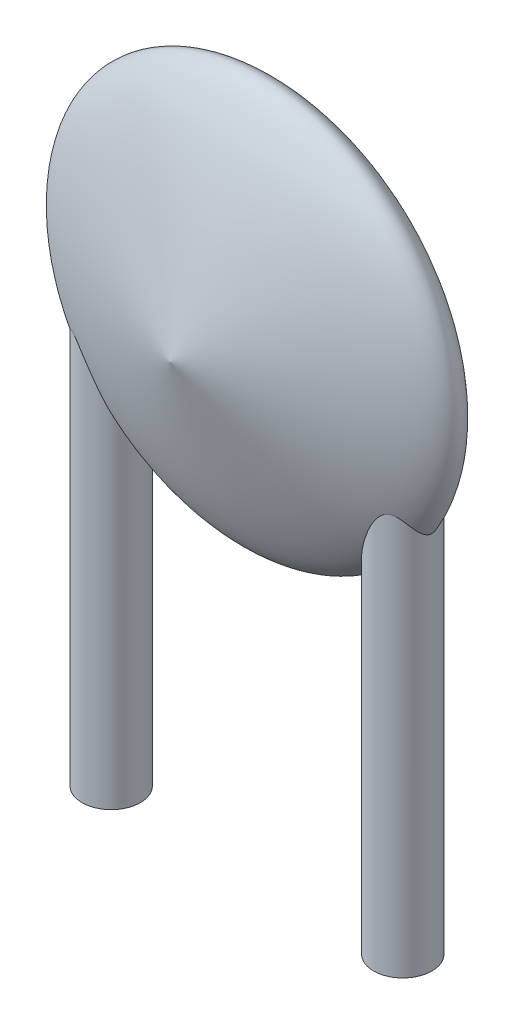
ISO-10303-21;
HEADER;
FILE_DESCRIPTION(('STEP AP214'),'2;1');
FILE_NAME('part.step','',(''),(''),'','','');
FILE_SCHEMA(('AUTOMOTIVE_DESIGN { 1 0 10303 214 1 1 1 1 }'));
ENDSEC;
DATA;
#1=APPLICATION_CONTEXT('core data for automotive mechanical design processes');
#2=APPLICATION_PROTOCOL_DEFINITION('international standard','automotive_design',2000,#1);
#3=PRODUCT_CONTEXT('',#1,'mechanical');
#4=PRODUCT('Part','Part','',(#3));
#5=PRODUCT_RELATED_PRODUCT_CATEGORY('part','',(#4));
#6=PRODUCT_DEFINITION_FORMATION('','',#4);
#7=PRODUCT_DEFINITION_CONTEXT('part definition',#1,'design');
#8=PRODUCT_DEFINITION('design','',#6,#7);
#9=PRODUCT_DEFINITION_SHAPE('','',#8);
#10=(LENGTH_UNIT() NAMED_UNIT(*) SI_UNIT(.MILLI.,.METRE.));
#11=(NAMED_UNIT(*) PLANE_ANGLE_UNIT() SI_UNIT($,.RADIAN.));
#12=(NAMED_UNIT(*) SI_UNIT($,.STERADIAN.) SOLID_ANGLE_UNIT());
#13=UNCERTAINTY_MEASURE_WITH_UNIT(LENGTH_MEASURE(1.E-05),#10,'distance_accuracy_value','');
#14=(GEOMETRIC_REPRESENTATION_CONTEXT(3) GLOBAL_UNCERTAINTY_ASSIGNED_CONTEXT((#13)) GLOBAL_UNIT_ASSIGNED_CONTEXT((#10,
#11,#12)) REPRESENTATION_CONTEXT('',''));
#15=CARTESIAN_POINT('',(0.,0.,0.));
#16=DIRECTION('',(0.,0.,1.));
#17=DIRECTION('',(1.,0.,0.));
#18=AXIS2_PLACEMENT_3D('',#15,#16,#17);
#19=CARTESIAN_POINT('',(-1.25,-4.15,0.));
#20=DIRECTION('',(0.,1.,0.));
#21=DIRECTION('',(0.,0.,1.));
#22=AXIS2_PLACEMENT_3D('',#19,#20,#21);
#23=CYLINDRICAL_SURFACE('',#22,0.25);
#24=CARTESIAN_POINT('',(-1.25,-4.15,0.));
#25=DIRECTION('',(0.,1.,0.));
#26=DIRECTION('',(0.,0.,1.));
#27=AXIS2_PLACEMENT_3D('',#24,#25,#26);
#28=CIRCLE('',#27,0.25);
#29=CARTESIAN_POINT('',(-1.25,-4.15,0.25));
#30=VERTEX_POINT('',#29);
#31=EDGE_CURVE('E41',#30,#30,#28,.T.);
#32=ORIENTED_EDGE('',*,*,#31,.T.);
#33=EDGE_LOOP('',(#32));
#34=FACE_BOUND('',#33,.T.);
#35=CARTESIAN_POINT('',(-1.25,-0.812285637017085,0.25));
#36=CARTESIAN_POINT('',(-1.23723943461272,-0.831909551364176,0.250003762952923));
#37=CARTESIAN_POINT('',(-1.22557482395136,-0.852224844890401,0.249058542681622));
#38=CARTESIAN_POINT('',(-1.20349428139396,-0.89343976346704,0.245884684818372));
#39=CARTESIAN_POINT('',(-1.19308086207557,-0.914340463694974,0.243653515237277));
#40=CARTESIAN_POINT('',(-1.17311282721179,-0.956468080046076,0.238109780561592));
#41=CARTESIAN_POINT('',(-1.1635603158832,-0.977695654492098,0.23479465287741));
#42=CARTESIAN_POINT('',(-1.14514503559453,-1.02023493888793,0.227164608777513));
#43=CARTESIAN_POINT('',(-1.13628156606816,-1.0415465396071,0.222850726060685));
#44=CARTESIAN_POINT('',(-1.11117632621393,-1.10388322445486,0.208785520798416));
#45=CARTESIAN_POINT('',(-1.09568337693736,-1.14493052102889,0.197692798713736));
#46=CARTESIAN_POINT('',(-1.07381788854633,-1.20579913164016,0.177638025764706));
#47=CARTESIAN_POINT('',(-1.06676518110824,-1.22595047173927,0.170393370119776));
#48=CARTESIAN_POINT('',(-1.05314353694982,-1.2658253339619,0.15446138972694));
#49=CARTESIAN_POINT('',(-1.0465740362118,-1.28554933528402,0.145775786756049));
#50=CARTESIAN_POINT('',(-1.03513281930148,-1.32071392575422,0.128149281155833));
#51=CARTESIAN_POINT('',(-1.0301689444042,-1.33628398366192,0.119538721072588));
#52=CARTESIAN_POINT('',(-1.02311606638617,-1.35883002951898,0.105127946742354));
#53=CARTESIAN_POINT('',(-1.02082920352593,-1.36621518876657,0.100071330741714));
#54=CARTESIAN_POINT('',(-1.01642995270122,-1.38055942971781,0.0893248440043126));
#55=CARTESIAN_POINT('',(-1.01431735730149,-1.38751901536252,0.0836357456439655));
#56=CARTESIAN_POINT('',(-1.01030791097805,-1.40085395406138,0.0713444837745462));
#57=CARTESIAN_POINT('',(-1.00841430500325,-1.40722030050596,0.064731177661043));
#58=CARTESIAN_POINT('',(-1.00503251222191,-1.41869716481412,0.0504469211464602));
#59=CARTESIAN_POINT('',(-1.00354090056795,-1.42381825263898,0.042785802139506));
#60=CARTESIAN_POINT('',(-1.00133696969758,-1.43144583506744,0.0268922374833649));
#61=CARTESIAN_POINT('',(-1.00056706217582,-1.43414461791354,0.0187714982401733));
#62=CARTESIAN_POINT('',(-1.00004053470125,-1.43599607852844,0.00620115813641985));
#63=CARTESIAN_POINT('',(-0.999971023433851,-1.43624267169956,0.00192344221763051));
#64=CARTESIAN_POINT('',(-1.0000508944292,-1.43596113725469,-0.00660504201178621));
#65=CARTESIAN_POINT('',(-1.00020036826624,-1.43543268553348,-0.0108557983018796));
#66=CARTESIAN_POINT('',(-1.00101229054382,-1.43258438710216,-0.0243130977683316));
#67=CARTESIAN_POINT('',(-1.00207919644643,-1.4288618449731,-0.0331979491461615));
#68=CARTESIAN_POINT('',(-1.00455815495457,-1.42032862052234,-0.0480117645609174));
#69=CARTESIAN_POINT('',(-1.0058674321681,-1.41585467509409,-0.0541823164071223));
#70=CARTESIAN_POINT('',(-1.00874493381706,-1.40611210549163,-0.0658128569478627));
#71=CARTESIAN_POINT('',(-1.01031382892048,-1.40084142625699,-0.0712709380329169));
#72=CARTESIAN_POINT('',(-1.0142333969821,-1.38779011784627,-0.0834832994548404));
#73=CARTESIAN_POINT('',(-1.01665993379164,-1.37979726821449,-0.0899800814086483));
#74=CARTESIAN_POINT('',(-1.0217287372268,-1.36329762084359,-0.102152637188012));
#75=CARTESIAN_POINT('',(-1.0243708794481,-1.35479112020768,-0.107828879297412));
#76=CARTESIAN_POINT('',(-1.03257900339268,-1.32867031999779,-0.124001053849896));
#77=CARTESIAN_POINT('',(-1.03839579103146,-1.31055812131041,-0.133555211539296));
#78=CARTESIAN_POINT('',(-1.05363849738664,-1.26420089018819,-0.155571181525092));
#79=CARTESIAN_POINT('',(-1.06337146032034,-1.23557306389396,-0.166970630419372));
#80=CARTESIAN_POINT('',(-1.08378065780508,-1.17773987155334,-0.187286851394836));
#81=CARTESIAN_POINT('',(-1.09445868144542,-1.14853349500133,-0.196198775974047));
#82=CARTESIAN_POINT('',(-1.11673939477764,-1.09006280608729,-0.21195983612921));
#83=CARTESIAN_POINT('',(-1.12833827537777,-1.06079917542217,-0.218816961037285));
#84=CARTESIAN_POINT('',(-1.15265740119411,-1.00240062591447,-0.230668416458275));
#85=CARTESIAN_POINT('',(-1.16537613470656,-0.973265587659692,-0.235665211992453));
#86=CARTESIAN_POINT('',(-1.18698486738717,-0.92702065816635,-0.242074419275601));
#87=CARTESIAN_POINT('',(-1.19537049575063,-0.909763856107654,-0.244121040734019));
#88=CARTESIAN_POINT('',(-1.21294978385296,-0.87548487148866,-0.247401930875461));
#89=CARTESIAN_POINT('',(-1.22214695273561,-0.858464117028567,-0.248632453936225));
#90=CARTESIAN_POINT('',(-1.24179314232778,-0.824781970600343,-0.250065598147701));
#91=CARTESIAN_POINT('',(-1.25225664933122,-0.808127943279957,-0.250254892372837));
#92=CARTESIAN_POINT('',(-1.26937075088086,-0.784275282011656,-0.249311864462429));
#93=CARTESIAN_POINT('',(-1.27528730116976,-0.776539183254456,-0.248797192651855));
#94=CARTESIAN_POINT('',(-1.28777545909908,-0.761689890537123,-0.247209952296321));
#95=CARTESIAN_POINT('',(-1.29434615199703,-0.754575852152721,-0.246138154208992));
#96=CARTESIAN_POINT('',(-1.30952295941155,-0.740378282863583,-0.242955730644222));
#97=CARTESIAN_POINT('',(-1.31828669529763,-0.733472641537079,-0.240709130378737));
#98=CARTESIAN_POINT('',(-1.33500034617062,-0.724288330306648,-0.235222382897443));
#99=CARTESIAN_POINT('',(-1.34263193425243,-0.721293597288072,-0.232355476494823));
#100=CARTESIAN_POINT('',(-1.35421462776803,-0.719090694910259,-0.227283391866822));
#101=CARTESIAN_POINT('',(-1.35811700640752,-0.718741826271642,-0.225453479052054));
#102=CARTESIAN_POINT('',(-1.36581564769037,-0.718823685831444,-0.221597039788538));
#103=CARTESIAN_POINT('',(-1.36961184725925,-0.719254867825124,-0.219570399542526));
#104=CARTESIAN_POINT('',(-1.381869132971,-0.721851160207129,-0.212619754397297));
#105=CARTESIAN_POINT('',(-1.38983598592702,-0.725557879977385,-0.20741957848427));
#106=CARTESIAN_POINT('',(-1.40353835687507,-0.734437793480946,-0.197465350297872));
#107=CARTESIAN_POINT('',(-1.40941588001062,-0.739432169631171,-0.192717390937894));
#108=CARTESIAN_POINT('',(-1.42032818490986,-0.750246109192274,-0.183140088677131));
#109=CARTESIAN_POINT('',(-1.42535945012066,-0.756068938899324,-0.17831049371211));
#110=CARTESIAN_POINT('',(-1.43560551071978,-0.769217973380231,-0.167674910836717));
#111=CARTESIAN_POINT('',(-1.44069061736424,-0.776626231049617,-0.161849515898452));
#112=CARTESIAN_POINT('',(-1.45018712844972,-0.791677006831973,-0.149943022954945));
#113=CARTESIAN_POINT('',(-1.45459771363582,-0.799319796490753,-0.143861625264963));
#114=CARTESIAN_POINT('',(-1.46286608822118,-0.814598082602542,-0.131318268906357));
#115=CARTESIAN_POINT('',(-1.46672367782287,-0.822233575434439,-0.12485617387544));
#116=CARTESIAN_POINT('',(-1.47393732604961,-0.837258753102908,-0.111401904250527));
#117=CARTESIAN_POINT('',(-1.4772939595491,-0.844648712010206,-0.104410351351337));
#118=CARTESIAN_POINT('',(-1.48343739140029,-0.858747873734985,-0.0898231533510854));
#119=CARTESIAN_POINT('',(-1.48623433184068,-0.86546781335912,-0.0822425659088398));
#120=CARTESIAN_POINT('',(-1.4912362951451,-0.877893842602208,-0.0661548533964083));
#121=CARTESIAN_POINT('',(-1.49344418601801,-0.88360479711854,-0.0576525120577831));
#122=CARTESIAN_POINT('',(-1.49710890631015,-0.893328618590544,-0.0390822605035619));
#123=CARTESIAN_POINT('',(-1.49853921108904,-0.897280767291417,-0.0289726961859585));
#124=CARTESIAN_POINT('',(-1.49971453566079,-0.900572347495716,-0.0130975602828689));
#125=CARTESIAN_POINT('',(-1.49994277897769,-0.901225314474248,-0.00764776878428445));
#126=CARTESIAN_POINT('',(-1.50003814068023,-0.901495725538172,0.00327970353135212));
#127=CARTESIAN_POINT('',(-1.49990539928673,-0.901113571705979,0.00875737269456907));
#128=CARTESIAN_POINT('',(-1.49906547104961,-0.898749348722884,0.0235513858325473));
#129=CARTESIAN_POINT('',(-1.49800412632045,-0.895787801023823,0.0326887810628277));
#130=CARTESIAN_POINT('',(-1.49525528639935,-0.888383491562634,0.0491371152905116));
#131=CARTESIAN_POINT('',(-1.49363239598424,-0.884097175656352,0.0565383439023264));
#132=CARTESIAN_POINT('',(-1.48992518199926,-0.874609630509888,0.070631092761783));
#133=CARTESIAN_POINT('',(-1.48783885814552,-0.869404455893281,0.0773193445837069));
#134=CARTESIAN_POINT('',(-1.48247233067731,-0.856471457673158,0.0924268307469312));
#135=CARTESIAN_POINT('',(-1.47903411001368,-0.848515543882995,0.100588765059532));
#136=CARTESIAN_POINT('',(-1.47154588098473,-0.832144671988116,0.116154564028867));
#137=CARTESIAN_POINT('',(-1.46749447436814,-0.823728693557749,0.123556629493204));
#138=CARTESIAN_POINT('',(-1.4587303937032,-0.806762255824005,0.1378479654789));
#139=CARTESIAN_POINT('',(-1.45401591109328,-0.798211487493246,0.144735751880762));
#140=CARTESIAN_POINT('',(-1.44380071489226,-0.781322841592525,0.158153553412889));
#141=CARTESIAN_POINT('',(-1.43830142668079,-0.772984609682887,0.164684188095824));
#142=CARTESIAN_POINT('',(-1.42737851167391,-0.758498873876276,0.176316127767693));
#143=CARTESIAN_POINT('',(-1.42214436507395,-0.752238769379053,0.181450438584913));
#144=CARTESIAN_POINT('',(-1.41074949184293,-0.740605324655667,0.191620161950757));
#145=CARTESIAN_POINT('',(-1.40459482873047,-0.735226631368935,0.196655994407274));
#146=CARTESIAN_POINT('',(-1.39126267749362,-0.726395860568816,0.206417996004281));
#147=CARTESIAN_POINT('',(-1.38414758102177,-0.72286447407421,0.211147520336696));
#148=CARTESIAN_POINT('',(-1.37259247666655,-0.719754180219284,0.217925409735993));
#149=CARTESIAN_POINT('',(-1.36855951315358,-0.719085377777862,0.220147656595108));
#150=CARTESIAN_POINT('',(-1.36033917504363,-0.718640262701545,0.224380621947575));
#151=CARTESIAN_POINT('',(-1.35615203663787,-0.718862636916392,0.226391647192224));
#152=CARTESIAN_POINT('',(-1.34476464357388,-0.720712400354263,0.231476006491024));
#153=CARTESIAN_POINT('',(-1.33757934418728,-0.723241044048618,0.234263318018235));
#154=CARTESIAN_POINT('',(-1.32023122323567,-0.731983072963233,0.240198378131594));
#155=CARTESIAN_POINT('',(-1.31055909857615,-0.739449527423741,0.242726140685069));
#156=CARTESIAN_POINT('',(-1.29161484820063,-0.75708689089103,0.246724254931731));
#157=CARTESIAN_POINT('',(-1.28254397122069,-0.767479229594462,0.248022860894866));
#158=CARTESIAN_POINT('',(-1.26551658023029,-0.789258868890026,0.249661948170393));
#159=CARTESIAN_POINT('',(-1.25756566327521,-0.80065073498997,0.249997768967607));
#160=CARTESIAN_POINT('',(-1.25,-0.812285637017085,0.25));
#161=B_SPLINE_CURVE_WITH_KNOTS('',3,(#35,#36,#37,#38,#39,#40,#41,#42,#43,#44,#45,#46,#47,#48,
#49,#50,#51,#52,#53,#54,#55,#56,#57,#58,#59,#60,#61,#62,#63,#64,#65,#66,#67,#68,#69,#70,#71,#72,
#73,#74,#75,#76,#77,#78,#79,#80,#81,#82,#83,#84,#85,#86,#87,#88,#89,#90,#91,#92,#93,#94,#95,#96,
#97,#98,#99,#100,#101,#102,#103,#104,#105,#106,#107,#108,#109,#110,#111,#112,#113,#114,#115,
#116,#117,#118,#119,#120,#121,#122,#123,#124,#125,#126,#127,#128,#129,#130,#131,#132,#133,#134,
#135,#136,#137,#138,#139,#140,#141,#142,#143,#144,#145,#146,#147,#148,#149,#150,#151,#152,#153,
#154,#155,#156,#157,#158,#159,#160),.UNSPECIFIED.,.T.,.F.,(4,2,2,2,2,2,2,2,2,2,2,2,2,2,2,2,2,2,
2,2,2,2,2,2,2,2,2,2,2,2,2,2,2,2,2,2,2,2,2,2,2,2,2,2,2,2,2,2,2,2,2,2,2,2,2,2,2,2,2,2,2,2,4),(0.,
0.0701915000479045,0.140521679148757,0.211019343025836,0.28144436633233,0.416933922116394,
0.484534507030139,0.552054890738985,0.607362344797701,0.635052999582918,0.662710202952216,
0.69073543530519,0.718513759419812,0.743817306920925,0.756599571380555,0.769387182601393,
0.797871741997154,0.820994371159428,0.84417769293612,0.875852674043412,0.907509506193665,
0.97123156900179,1.06800645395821,1.16496863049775,1.2615487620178,1.35800046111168,
1.41585830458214,1.4739798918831,1.53284368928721,1.56205890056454,1.59123381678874,
1.62496006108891,1.65050459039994,1.66340038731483,1.67630368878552,1.70632895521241,
1.73341854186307,1.76061805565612,1.7927086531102,1.8248379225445,1.85697877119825,
1.88908244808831,1.92053755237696,1.9518365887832,1.98414524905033,2.00052430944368,
2.01689700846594,2.04546175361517,2.07146776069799,2.09758827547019,2.13322672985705,
2.16894771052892,2.20476808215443,2.24052420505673,2.2693926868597,2.29807876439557,
2.32540366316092,2.33927916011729,2.35313421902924,2.37702784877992,2.41384063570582,
2.4552566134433,2.49687273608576),.UNSPECIFIED.);
#162=CARTESIAN_POINT('',(-1.25,-0.812285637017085,0.25));
#163=VERTEX_POINT('',#162);
#164=EDGE_CURVE('E11',#163,#163,#161,.T.);
#165=ORIENTED_EDGE('',*,*,#164,.F.);
#166=EDGE_LOOP('',(#165));
#167=FACE_BOUND('',#166,.T.);
#168=ADVANCED_FACE('F27',(#34,#167),#23,.T.);
#169=CARTESIAN_POINT('',(-1.25,-4.15,0.));
#170=DIRECTION('',(0.,1.,0.));
#171=DIRECTION('',(0.,0.,1.));
#172=AXIS2_PLACEMENT_3D('',#169,#170,#171);
#173=PLANE('',#172);
#174=ORIENTED_EDGE('',*,*,#31,.F.);
#175=EDGE_LOOP('',(#174));
#176=FACE_BOUND('',#175,.T.);
#177=ADVANCED_FACE('F49',(#176),#173,.F.);
#178=CARTESIAN_POINT('',(0.,0.,-0.75));
#179=CARTESIAN_POINT('',(0.,0.875,-0.5));
#180=CARTESIAN_POINT('',(0.,2.625,0.));
#181=CARTESIAN_POINT('',(0.,0.875,0.5));
#182=CARTESIAN_POINT('',(0.,0.,0.75));
#183=B_SPLINE_CURVE_WITH_KNOTS('',3,(#178,#179,#180,#181,#182),.UNSPECIFIED.,.F.,.F.,(4,1,4),
(0.,0.5,1.),.UNSPECIFIED.);
#184=CARTESIAN_POINT('',(0.,0.,4.80283073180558));
#185=DIRECTION('',(0.,0.,1.));
#186=AXIS1_PLACEMENT('',#184,#185);
#187=SURFACE_OF_REVOLUTION('',#183,#186);
#188=CARTESIAN_POINT('',(1.25,-0.812285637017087,0.25));
#189=CARTESIAN_POINT('',(1.25772331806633,-0.800394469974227,0.250001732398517));
#190=CARTESIAN_POINT('',(1.26585403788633,-0.788755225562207,0.249653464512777));
#191=CARTESIAN_POINT('',(1.27896746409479,-0.772093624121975,0.248353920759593));
#192=CARTESIAN_POINT('',(1.28348190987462,-0.766682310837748,0.247793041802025));
#193=CARTESIAN_POINT('',(1.29289679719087,-0.756259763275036,0.246338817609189));
#194=CARTESIAN_POINT('',(1.29779763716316,-0.751248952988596,0.245445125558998));
#195=CARTESIAN_POINT('',(1.31158514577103,-0.738662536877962,0.2424564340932));
#196=CARTESIAN_POINT('',(1.32095273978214,-0.731601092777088,0.239957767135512));
#197=CARTESIAN_POINT('',(1.33455829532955,-0.724769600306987,0.235294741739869));
#198=CARTESIAN_POINT('',(1.33818176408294,-0.723241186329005,0.233965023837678));
#199=CARTESIAN_POINT('',(1.34553551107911,-0.720818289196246,0.231059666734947));
#200=CARTESIAN_POINT('',(1.34926550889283,-0.719922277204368,0.229484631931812));
#201=CARTESIAN_POINT('',(1.35674938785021,-0.718844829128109,0.226100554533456));
#202=CARTESIAN_POINT('',(1.36050328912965,-0.718667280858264,0.224290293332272));
#203=CARTESIAN_POINT('',(1.36788819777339,-0.719032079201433,0.220498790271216));
#204=CARTESIAN_POINT('',(1.37151909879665,-0.71957503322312,0.21851740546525));
#205=CARTESIAN_POINT('',(1.38381574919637,-0.722567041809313,0.211413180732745));
#206=CARTESIAN_POINT('',(1.39190985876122,-0.726651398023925,0.206014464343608));
#207=CARTESIAN_POINT('',(1.40600428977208,-0.736363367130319,0.195541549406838));
#208=CARTESIAN_POINT('',(1.41211075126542,-0.741864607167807,0.190470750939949));
#209=CARTESIAN_POINT('',(1.42342149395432,-0.753704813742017,0.180228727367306));
#210=CARTESIAN_POINT('',(1.42862119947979,-0.760047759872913,0.17505713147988));
#211=CARTESIAN_POINT('',(1.43927915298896,-0.774432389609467,0.163545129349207));
#212=CARTESIAN_POINT('',(1.44458397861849,-0.782561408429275,0.15717641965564));
#213=CARTESIAN_POINT('',(1.45445628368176,-0.799002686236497,0.144098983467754));
#214=CARTESIAN_POINT('',(1.45902301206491,-0.807315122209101,0.137389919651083));
#215=CARTESIAN_POINT('',(1.46752454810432,-0.823800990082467,0.123487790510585));
#216=CARTESIAN_POINT('',(1.47146157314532,-0.831974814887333,0.116296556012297));
#217=CARTESIAN_POINT('',(1.47876342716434,-0.847910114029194,0.101183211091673));
#218=CARTESIAN_POINT('',(1.48212825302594,-0.855671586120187,0.0932610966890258));
#219=CARTESIAN_POINT('',(1.48738414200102,-0.868290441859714,0.0786820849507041));
#220=CARTESIAN_POINT('',(1.48942666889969,-0.873361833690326,0.0722710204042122));
#221=CARTESIAN_POINT('',(1.49309126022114,-0.88269140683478,0.0587879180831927));
#222=CARTESIAN_POINT('',(1.49471422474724,-0.886951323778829,0.0517173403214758));
#223=CARTESIAN_POINT('',(1.49776831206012,-0.89512991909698,0.0346789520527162));
#224=CARTESIAN_POINT('',(1.49902488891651,-0.89863494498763,0.0244482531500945));
#225=CARTESIAN_POINT('',(1.49991217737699,-0.901132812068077,0.00854156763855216));
#226=CARTESIAN_POINT('',(1.50003931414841,-0.901499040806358,0.00311073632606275));
#227=CARTESIAN_POINT('',(1.49993941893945,-0.901215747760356,-0.00772229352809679));
#228=CARTESIAN_POINT('',(1.49971224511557,-0.900565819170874,-0.0131244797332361));
#229=CARTESIAN_POINT('',(1.49845081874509,-0.897033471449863,-0.0301754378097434));
#230=CARTESIAN_POINT('',(1.49676993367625,-0.892394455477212,-0.0414010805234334));
#231=CARTESIAN_POINT('',(1.4926676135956,-0.881586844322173,-0.0608336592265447));
#232=CARTESIAN_POINT('',(1.49036720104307,-0.875687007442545,-0.0692428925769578));
#233=CARTESIAN_POINT('',(1.48518969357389,-0.862943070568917,-0.0851774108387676));
#234=CARTESIAN_POINT('',(1.48230971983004,-0.856094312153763,-0.0926979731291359));
#235=CARTESIAN_POINT('',(1.47555038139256,-0.840758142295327,-0.108214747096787));
#236=CARTESIAN_POINT('',(1.47158456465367,-0.832186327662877,-0.116086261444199));
#237=CARTESIAN_POINT('',(1.46298221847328,-0.814804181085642,-0.13120245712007));
#238=CARTESIAN_POINT('',(1.45834447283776,-0.805993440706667,-0.138445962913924));
#239=CARTESIAN_POINT('',(1.44830893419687,-0.788531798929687,-0.152471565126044));
#240=CARTESIAN_POINT('',(1.44291534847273,-0.779880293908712,-0.15925592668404));
#241=CARTESIAN_POINT('',(1.4311000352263,-0.763100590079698,-0.172576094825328));
#242=CARTESIAN_POINT('',(1.42468041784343,-0.754971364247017,-0.179112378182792));
#243=CARTESIAN_POINT('',(1.41388286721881,-0.743746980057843,-0.188853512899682));
#244=CARTESIAN_POINT('',(1.41007355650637,-0.740156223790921,-0.192101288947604));
#245=CARTESIAN_POINT('',(1.40198895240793,-0.733517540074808,-0.19856095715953));
#246=CARTESIAN_POINT('',(1.39771397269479,-0.730469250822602,-0.201772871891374));
#247=CARTESIAN_POINT('',(1.38623063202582,-0.723853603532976,-0.20978874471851));
#248=CARTESIAN_POINT('',(1.37864146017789,-0.720820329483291,-0.21456535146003));
#249=CARTESIAN_POINT('',(1.36373577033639,-0.718428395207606,-0.222762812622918));
#250=CARTESIAN_POINT('',(1.35656662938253,-0.718563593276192,-0.226278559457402));
#251=CARTESIAN_POINT('',(1.34242829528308,-0.721422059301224,-0.232416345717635));
#252=CARTESIAN_POINT('',(1.33545874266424,-0.724140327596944,-0.235040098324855));
#253=CARTESIAN_POINT('',(1.31794313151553,-0.733504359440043,-0.240869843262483));
#254=CARTESIAN_POINT('',(1.30797856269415,-0.741551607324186,-0.243365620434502));
#255=CARTESIAN_POINT('',(1.2928182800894,-0.756251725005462,-0.246380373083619));
#256=CARTESIAN_POINT('',(1.2871579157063,-0.762438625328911,-0.247283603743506));
#257=CARTESIAN_POINT('',(1.27633276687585,-0.775282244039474,-0.248668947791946));
#258=CARTESIAN_POINT('',(1.2711676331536,-0.781938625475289,-0.249151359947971));
#259=CARTESIAN_POINT('',(1.25617895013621,-0.802420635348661,-0.250126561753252));
#260=CARTESIAN_POINT('',(1.24693512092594,-0.816679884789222,-0.25013509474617));
#261=CARTESIAN_POINT('',(1.22335453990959,-0.855698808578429,-0.249018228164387));
#262=CARTESIAN_POINT('',(1.20988434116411,-0.880939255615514,-0.247109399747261));
#263=CARTESIAN_POINT('',(1.18442973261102,-0.932004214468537,-0.241593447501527));
#264=CARTESIAN_POINT('',(1.1724484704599,-0.957829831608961,-0.237982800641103));
#265=CARTESIAN_POINT('',(1.14957796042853,-1.00963086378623,-0.229270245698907));
#266=CARTESIAN_POINT('',(1.13868604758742,-1.03560574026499,-0.224172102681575));
#267=CARTESIAN_POINT('',(1.11775215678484,-1.08752715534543,-0.212494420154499));
#268=CARTESIAN_POINT('',(1.1077091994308,-1.11347369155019,-0.205916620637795));
#269=CARTESIAN_POINT('',(1.08979572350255,-1.16135555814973,-0.192203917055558));
#270=CARTESIAN_POINT('',(1.08182350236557,-1.18331696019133,-0.185295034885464));
#271=CARTESIAN_POINT('',(1.06638916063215,-1.2269928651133,-0.170015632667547));
#272=CARTESIAN_POINT('',(1.05892865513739,-1.24870642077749,-0.161640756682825));
#273=CARTESIAN_POINT('',(1.0445078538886,-1.29177571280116,-0.142887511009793));
#274=CARTESIAN_POINT('',(1.03755380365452,-1.31312508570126,-0.132488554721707));
#275=CARTESIAN_POINT('',(1.02775000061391,-1.34399401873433,-0.11467126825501));
#276=CARTESIAN_POINT('',(1.02459480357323,-1.35406379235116,-0.108383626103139));
#277=CARTESIAN_POINT('',(1.01855203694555,-1.37359722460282,-0.0948039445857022));
#278=CARTESIAN_POINT('',(1.01566415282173,-1.38306159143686,-0.0875131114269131));
#279=CARTESIAN_POINT('',(1.01146550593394,-1.39699531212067,-0.0749912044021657));
#280=CARTESIAN_POINT('',(1.01001486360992,-1.40184761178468,-0.0702424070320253));
#281=CARTESIAN_POINT('',(1.00729901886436,-1.41099592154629,-0.060195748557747));
#282=CARTESIAN_POINT('',(1.00603373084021,-1.41529218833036,-0.0548981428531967));
#283=CARTESIAN_POINT('',(1.00322717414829,-1.4248900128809,-0.0409268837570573));
#284=CARTESIAN_POINT('',(1.00183812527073,-1.42970694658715,-0.0318410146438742));
#285=CARTESIAN_POINT('',(1.00030600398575,-1.43505439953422,-0.0144748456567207));
#286=CARTESIAN_POINT('',(0.999956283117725,-1.43629398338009,-0.00645589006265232));
#287=CARTESIAN_POINT('',(1.00005309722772,-1.43595415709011,0.00951869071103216));
#288=CARTESIAN_POINT('',(1.0005004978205,-1.43437168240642,0.0174742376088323));
#289=CARTESIAN_POINT('',(1.00230231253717,-1.42809332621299,0.0354908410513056));
#290=CARTESIAN_POINT('',(1.00394542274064,-1.42241377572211,0.0451405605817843));
#291=CARTESIAN_POINT('',(1.00766256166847,-1.40975512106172,0.0619749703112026));
#292=CARTESIAN_POINT('',(1.00968871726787,-1.40292551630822,0.0692987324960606));
#293=CARTESIAN_POINT('',(1.01405264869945,-1.38838948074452,0.0829435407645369));
#294=CARTESIAN_POINT('',(1.01639137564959,-1.38068038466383,0.0892613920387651));
#295=CARTESIAN_POINT('',(1.02262151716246,-1.36037919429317,0.104398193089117));
#296=CARTESIAN_POINT('',(1.02665815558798,-1.34743799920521,0.112675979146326));
#297=CARTESIAN_POINT('',(1.03507162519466,-1.3209347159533,0.12798812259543));
#298=CARTESIAN_POINT('',(1.03944914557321,-1.30737139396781,0.135019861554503));
#299=CARTESIAN_POINT('',(1.05303021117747,-1.2660195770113,0.154798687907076));
#300=CARTESIAN_POINT('',(1.06264251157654,-1.23769967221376,0.166145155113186));
#301=CARTESIAN_POINT('',(1.08250319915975,-1.18130505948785,0.186102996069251));
#302=CARTESIAN_POINT('',(1.09272820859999,-1.15324349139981,0.194778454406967));
#303=CARTESIAN_POINT('',(1.11408281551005,-1.09689693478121,0.210240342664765));
#304=CARTESIAN_POINT('',(1.12521358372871,-1.06861170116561,0.217024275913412));
#305=CARTESIAN_POINT('',(1.14844279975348,-1.01229593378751,0.22881042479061));
#306=CARTESIAN_POINT('',(1.16053446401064,-0.984264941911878,0.233823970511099));
#307=CARTESIAN_POINT('',(1.18606470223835,-0.928577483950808,0.242062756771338));
#308=CARTESIAN_POINT('',(1.19950121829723,-0.900920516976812,0.24529068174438));
#309=CARTESIAN_POINT('',(1.21962294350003,-0.863324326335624,0.248210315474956));
#310=CARTESIAN_POINT('',(1.22537193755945,-0.85295965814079,0.248855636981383));
#311=CARTESIAN_POINT('',(1.23731737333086,-0.832432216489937,0.249750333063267));
#312=CARTESIAN_POINT('',(1.24351507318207,-0.822270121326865,0.249998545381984));
#313=CARTESIAN_POINT('',(1.25,-0.812285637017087,0.25));
#314=B_SPLINE_CURVE_WITH_KNOTS('',3,(#188,#189,#190,#191,#192,#193,#194,#195,#196,#197,#198,
#199,#200,#201,#202,#203,#204,#205,#206,#207,#208,#209,#210,#211,#212,#213,#214,#215,#216,#217,
#218,#219,#220,#221,#222,#223,#224,#225,#226,#227,#228,#229,#230,#231,#232,#233,#234,#235,#236,
#237,#238,#239,#240,#241,#242,#243,#244,#245,#246,#247,#248,#249,#250,#251,#252,#253,#254,#255,
#256,#257,#258,#259,#260,#261,#262,#263,#264,#265,#266,#267,#268,#269,#270,#271,#272,#273,#274,
#275,#276,#277,#278,#279,#280,#281,#282,#283,#284,#285,#286,#287,#288,#289,#290,#291,#292,#293,
#294,#295,#296,#297,#298,#299,#300,#301,#302,#303,#304,#305,#306,#307,#308,#309,#310,#311,#312,
#313),.UNSPECIFIED.,.T.,.F.,(4,2,2,2,2,2,2,2,2,2,2,2,2,2,2,2,2,2,2,2,2,2,2,2,2,2,2,2,2,2,2,2,2,
2,2,2,2,2,2,2,2,2,2,2,2,2,2,2,2,2,2,2,2,2,2,2,2,2,2,2,2,2,4),(0.,0.0425181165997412,
0.0636956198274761,0.0848952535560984,0.120212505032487,0.132618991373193,0.144995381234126,
0.157438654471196,0.169892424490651,0.200929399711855,0.229818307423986,0.258849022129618,
0.293640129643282,0.328466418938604,0.363167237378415,0.397868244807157,0.423086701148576,
0.448250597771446,0.480312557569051,0.496544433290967,0.512782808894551,0.548839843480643,
0.58032190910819,0.611964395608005,0.648803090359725,0.685709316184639,0.722417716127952,
0.759051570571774,0.777498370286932,0.795932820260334,0.823811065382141,0.84727145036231,
0.87068651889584,0.909155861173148,0.934453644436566,0.959733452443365,1.01061471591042,
1.09646872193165,1.18250124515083,1.26831786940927,1.35403410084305,1.42708178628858,
1.50035032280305,1.57440717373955,1.61122418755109,1.64799731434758,1.66878560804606,
1.68956427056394,1.72016394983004,1.74404308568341,1.76794816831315,1.80130575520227,
1.83185742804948,1.8625042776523,1.9100455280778,1.9576855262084,2.05344217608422,
2.14668043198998,2.24004117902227,2.33279312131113,2.42540524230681,2.46100182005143,
2.49670239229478),.UNSPECIFIED.);
#315=CARTESIAN_POINT('',(1.25,-0.812285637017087,0.25));
#316=VERTEX_POINT('',#315);
#317=EDGE_CURVE('E33',#316,#316,#314,.T.);
#318=ORIENTED_EDGE('',*,*,#317,.T.);
#319=EDGE_LOOP('',(#318));
#320=FACE_BOUND('',#319,.T.);
#321=ORIENTED_EDGE('',*,*,#164,.T.);
#322=EDGE_LOOP('',(#321));
#323=FACE_BOUND('',#322,.T.);
#324=CARTESIAN_POINT('',(0.,0.,0.75));
#325=VERTEX_POINT('',#324);
#326=VERTEX_LOOP('',#325);
#327=FACE_BOUND('',#326,.T.);
#328=CARTESIAN_POINT('',(0.,0.,-0.75));
#329=VERTEX_POINT('',#328);
#330=VERTEX_LOOP('',#329);
#331=FACE_BOUND('',#330,.T.);
#332=ADVANCED_FACE('F29',(#320,#323,#327,#331),#187,.T.);
#333=CARTESIAN_POINT('',(1.25,-4.15,0.));
#334=DIRECTION('',(0.,1.,0.));
#335=DIRECTION('',(0.,0.,1.));
#336=AXIS2_PLACEMENT_3D('',#333,#334,#335);
#337=CYLINDRICAL_SURFACE('',#336,0.25);
#338=CARTESIAN_POINT('',(1.25,-4.15,0.));
#339=DIRECTION('',(0.,1.,0.));
#340=DIRECTION('',(0.,0.,1.));
#341=AXIS2_PLACEMENT_3D('',#338,#339,#340);
#342=CIRCLE('',#341,0.25);
#343=CARTESIAN_POINT('',(1.25,-4.15,0.25));
#344=VERTEX_POINT('',#343);
#345=EDGE_CURVE('E78',#344,#344,#342,.T.);
#346=ORIENTED_EDGE('',*,*,#345,.T.);
#347=EDGE_LOOP('',(#346));
#348=FACE_BOUND('',#347,.T.);
#349=ORIENTED_EDGE('',*,*,#317,.F.);
#350=EDGE_LOOP('',(#349));
#351=FACE_BOUND('',#350,.T.);
#352=ADVANCED_FACE('F48',(#348,#351),#337,.T.);
#353=CARTESIAN_POINT('',(1.25,-4.15,0.));
#354=DIRECTION('',(0.,1.,0.));
#355=DIRECTION('',(0.,0.,1.));
#356=AXIS2_PLACEMENT_3D('',#353,#354,#355);
#357=PLANE('',#356);
#358=ORIENTED_EDGE('',*,*,#345,.F.);
#359=EDGE_LOOP('',(#358));
#360=FACE_BOUND('',#359,.T.);
#361=ADVANCED_FACE('F55',(#360),#357,.F.);
#362=CLOSED_SHELL('',(#168,#177,#332,#352,#361));
#363=MANIFOLD_SOLID_BREP('B2',#362);
#364=ADVANCED_BREP_SHAPE_REPRESENTATION('',(#18,#363),#14);
#365=SHAPE_DEFINITION_REPRESENTATION(#9,#364);
ENDSEC;
END-ISO-10303-21;
